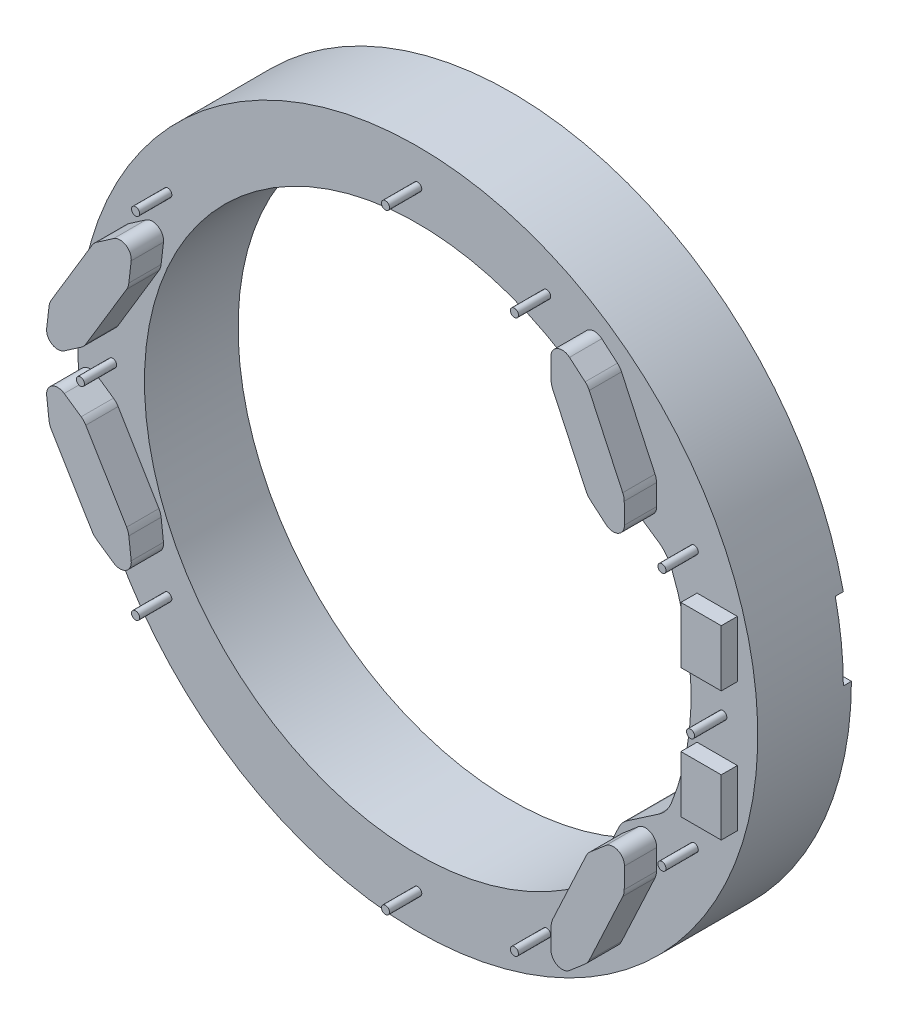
from build123d import *

# Parameters (mm, degrees)
SKETCH1_R           = 53.5
BOSS_EXTRUDE1_DEPTH = 14.732
SKETCH2_R           = 0.635
BOSS_EXTRUDE2_DEPTH = 5.08
SKETCH4_W           = 6.35
SKETCH4_H           = 8.89
BOSS_EXTRUDE3_DEPTH = 2.54
SKETCH3_W           = 68.30449101
SKETCH3_H           = 11.578391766
CUT_EXTRUDE1_DEPTH  = 1.27


with BuildPart() as part:
    # Sketch1 → Boss-Extrude1 (new body)
    with BuildSketch(Plane.XY):
        Circle(SKETCH1_R)
        with BuildLine():
            Line((37.892670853, 18.540378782), (32.911771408, 21.945563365))
            ThreePointArc((32.911771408, 21.945563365), (32.178928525, 22.605853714), (31.646593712, 23.436312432))
            Line((31.646593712, 23.436312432), (27.511337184, 32.304398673))
            ThreePointArc((27.511337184, 32.304398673), (26.798553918, 33.444213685), (25.830552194, 34.377064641))
            ThreePointArc((25.830552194, 34.377064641), (-43, 0), (25.830552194, -34.377064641))
            ThreePointArc((25.830552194, -34.377064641), (26.798553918, -33.444213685), (27.511337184, -32.304398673))
            Line((27.511337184, -32.304398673), (31.646593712, -23.436312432))
            ThreePointArc((31.646593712, -23.436312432), (32.178928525, -22.605853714), (32.911771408, -21.945563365))
            Line((32.911771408, -21.945563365), (37.892670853, -18.540378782))
            ThreePointArc((37.892670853, -18.540378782), (39.076120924, -17.444934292), (39.890982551, -16.053333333))
            ThreePointArc((39.890982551, -16.053333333), (43, 0), (39.890982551, 16.053333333))
            ThreePointArc((39.890982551, 16.053333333), (39.076120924, 17.444934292), (37.892670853, 18.540378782))
        make_face(mode=Mode.SUBTRACT)
    extrude(amount=BOSS_EXTRUDE1_DEPTH)

    # Sketch2 → Boss-Extrude2 (add)
    with BuildSketch(Plane.XY.offset(14.732)):
        with Locations((48, 0)):
            Circle(SKETCH2_R)
        with Locations((43.502773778, 20.285676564)):
            Circle(SKETCH2_R)
        with Locations((20.285676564, 43.502773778)):
            Circle(SKETCH2_R)
        with Locations((0, 48)):
            Circle(SKETCH2_R)
        with Locations((-39.319298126, 27.531668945)):
            Circle(SKETCH2_R)
        with Locations((-48, 0)):
            Circle(SKETCH2_R)
        with Locations((43.502773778, -20.285676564)):
            Circle(SKETCH2_R)
        with Locations((20.285676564, -43.502773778)):
            Circle(SKETCH2_R)
        with Locations((0, -48)):
            Circle(SKETCH2_R)
        with Locations((-39.319298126, -27.531668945)):
            Circle(SKETCH2_R)
        with BuildLine():
            Line((28.956431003, 41.772690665), (31.4147172, 39.664875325))
            ThreePointArc((31.4147172, 39.664875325), (31.784716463, 39.272129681), (32.063406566, 38.810090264))
            Line((32.063406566, 38.810090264), (37.331258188, 27.513146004))
            ThreePointArc((37.331258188, 27.513146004), (37.50606237, 27.002663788), (37.569092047, 26.466775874))
            Line((37.569092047, 26.466775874), (37.603616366, 23.228741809))
            ThreePointArc((37.603616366, 23.228741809), (36.582306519, 21.606588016), (34.683179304, 21.866919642))
            Line((34.683179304, 21.866919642), (32.224893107, 23.974734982))
            ThreePointArc((32.224893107, 23.974734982), (31.854893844, 24.367480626), (31.576203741, 24.829520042))
            Line((31.576203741, 24.829520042), (26.308352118, 36.126464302))
            ThreePointArc((26.308352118, 36.126464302), (26.133547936, 36.636946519), (26.07051826, 37.172834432))
            Line((26.07051826, 37.172834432), (26.03599394, 40.410868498))
            ThreePointArc((26.03599394, 40.410868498), (27.057303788, 42.033022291), (28.956431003, 41.772690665))
        make_face()
        with BuildLine():
            Line((-53.304354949, 4.561532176), (-52.931553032, 7.778219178))
            ThreePointArc((-52.931553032, 7.778219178), (-52.812853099, 8.304583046), (-52.585646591, 8.793996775))
            Line((-52.585646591, 8.793996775), (-46.165800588, 19.478414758))
            ThreePointArc((-46.165800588, 19.478414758), (-45.840340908, 19.908792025), (-45.431315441, 20.260710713))
            Line((-45.431315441, 20.260710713), (-42.766169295, 22.100018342))
            ThreePointArc((-42.766169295, 22.100018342), (-40.850233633, 22.160410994), (-40.004079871, 20.440387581))
            Line((-40.004079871, 20.440387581), (-40.376881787, 17.223700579))
            ThreePointArc((-40.376881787, 17.223700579), (-40.49558172, 16.697336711), (-40.722788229, 16.207922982))
            Line((-40.722788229, 16.207922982), (-47.142634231, 5.523504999))
            ThreePointArc((-47.142634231, 5.523504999), (-47.468093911, 5.093127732), (-47.877119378, 4.741209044))
            Line((-47.877119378, 4.741209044), (-50.542265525, 2.901901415))
            ThreePointArc((-50.542265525, 2.901901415), (-52.458201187, 2.841508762), (-53.304354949, 4.561532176))
        make_face()
        with BuildLine():
            Line((-47.877119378, -4.741209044), (-50.542265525, -2.901901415))
            ThreePointArc((-50.542265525, -2.901901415), (-52.458201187, -2.841508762), (-53.304354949, -4.561532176))
            Line((-53.304354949, -4.561532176), (-52.931553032, -7.778219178))
            ThreePointArc((-52.931553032, -7.778219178), (-52.812853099, -8.304583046), (-52.585646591, -8.793996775))
            Line((-52.585646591, -8.793996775), (-46.165800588, -19.478414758))
            ThreePointArc((-46.165800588, -19.478414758), (-45.840340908, -19.908792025), (-45.431315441, -20.260710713))
            Line((-45.431315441, -20.260710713), (-42.766169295, -22.100018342))
            ThreePointArc((-42.766169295, -22.100018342), (-40.850233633, -22.160410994), (-40.004079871, -20.440387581))
            Line((-40.004079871, -20.440387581), (-40.376881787, -17.223700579))
            ThreePointArc((-40.376881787, -17.223700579), (-40.49558172, -16.697336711), (-40.722788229, -16.207922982))
            Line((-40.722788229, -16.207922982), (-47.142634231, -5.523504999))
            ThreePointArc((-47.142634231, -5.523504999), (-47.468093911, -5.093127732), (-47.877119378, -4.741209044))
        make_face()
        with BuildLine():
            Line((32.224893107, -23.974734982), (34.683179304, -21.866919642))
            ThreePointArc((34.683179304, -21.866919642), (36.582306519, -21.606588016), (37.603616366, -23.228741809))
            Line((37.603616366, -23.228741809), (37.569092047, -26.466775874))
            ThreePointArc((37.569092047, -26.466775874), (37.50606237, -27.002663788), (37.331258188, -27.513146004))
            Line((37.331258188, -27.513146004), (32.063406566, -38.810090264))
            ThreePointArc((32.063406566, -38.810090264), (31.784716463, -39.272129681), (31.4147172, -39.664875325))
            Line((31.4147172, -39.664875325), (28.956431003, -41.772690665))
            ThreePointArc((28.956431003, -41.772690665), (27.057303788, -42.033022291), (26.03599394, -40.410868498))
            Line((26.03599394, -40.410868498), (26.07051826, -37.172834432))
            ThreePointArc((26.07051826, -37.172834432), (26.133547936, -36.636946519), (26.308352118, -36.126464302))
            Line((26.308352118, -36.126464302), (31.576203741, -24.829520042))
            ThreePointArc((31.576203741, -24.829520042), (31.854893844, -24.367480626), (32.224893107, -23.974734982))
        make_face()
    extrude(amount=BOSS_EXTRUDE2_DEPTH)

    # Sketch4 → Boss-Extrude3 (add)
    with BuildSketch(Plane.XY.offset(14.732)):
        with Locations((47.117, -10.16)):
            Rectangle(SKETCH4_W, SKETCH4_H)
        with Locations((47.117, 10.16)):
            Rectangle(SKETCH4_W, SKETCH4_H)
    extrude(amount=BOSS_EXTRUDE3_DEPTH)

    # Sketch3 → Cut-Extrude1 (cut)
    with BuildSketch(Plane(origin=(0, 0, 0), x_dir=(-1, 0, 0), z_dir=(0, 0, -1))):
        with Locations((-34.152245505, 5.789195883)):
            Rectangle(SKETCH3_W, SKETCH3_H)
    extrude(amount=-CUT_EXTRUDE1_DEPTH, mode=Mode.SUBTRACT)


solid = part.part
